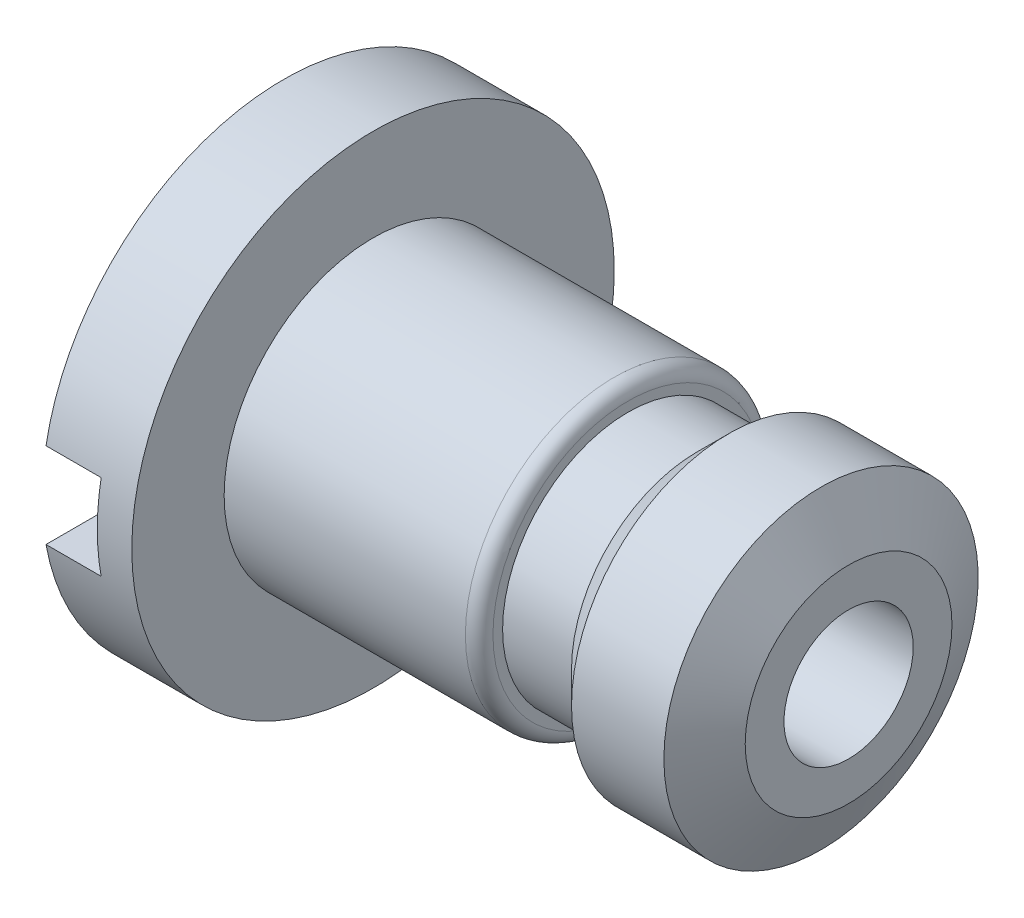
ISO-10303-21;
HEADER;
FILE_DESCRIPTION(('STEP AP214'),'2;1');
FILE_NAME('part.step','',(''),(''),'','','');
FILE_SCHEMA(('AUTOMOTIVE_DESIGN { 1 0 10303 214 1 1 1 1 }'));
ENDSEC;
DATA;
#1=APPLICATION_CONTEXT('core data for automotive mechanical design processes');
#2=APPLICATION_PROTOCOL_DEFINITION('international standard','automotive_design',2000,#1);
#3=PRODUCT_CONTEXT('',#1,'mechanical');
#4=PRODUCT('Part','Part','',(#3));
#5=PRODUCT_RELATED_PRODUCT_CATEGORY('part','',(#4));
#6=PRODUCT_DEFINITION_FORMATION('','',#4);
#7=PRODUCT_DEFINITION_CONTEXT('part definition',#1,'design');
#8=PRODUCT_DEFINITION('design','',#6,#7);
#9=PRODUCT_DEFINITION_SHAPE('','',#8);
#10=(LENGTH_UNIT() NAMED_UNIT(*) SI_UNIT(.MILLI.,.METRE.));
#11=(NAMED_UNIT(*) PLANE_ANGLE_UNIT() SI_UNIT($,.RADIAN.));
#12=(NAMED_UNIT(*) SI_UNIT($,.STERADIAN.) SOLID_ANGLE_UNIT());
#13=UNCERTAINTY_MEASURE_WITH_UNIT(LENGTH_MEASURE(1.E-05),#10,'distance_accuracy_value','');
#14=(GEOMETRIC_REPRESENTATION_CONTEXT(3) GLOBAL_UNCERTAINTY_ASSIGNED_CONTEXT((#13)) GLOBAL_UNIT_ASSIGNED_CONTEXT((#10,
#11,#12)) REPRESENTATION_CONTEXT('',''));
#15=CARTESIAN_POINT('',(0.,0.,0.));
#16=DIRECTION('',(0.,0.,1.));
#17=DIRECTION('',(1.,0.,0.));
#18=AXIS2_PLACEMENT_3D('',#15,#16,#17);
#19=CARTESIAN_POINT('',(1.016,-0.7874,-5.78340477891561));
#20=DIRECTION('',(-1.,0.,0.));
#21=DIRECTION('',(0.,0.,1.));
#22=AXIS2_PLACEMENT_3D('',#19,#20,#21);
#23=PLANE('',#22);
#24=CARTESIAN_POINT('',(1.016,0.,0.));
#25=DIRECTION('',(-1.,0.,0.));
#26=DIRECTION('',(0.,0.,1.));
#27=AXIS2_PLACEMENT_3D('',#24,#25,#26);
#28=CIRCLE('',#27,1.190625);
#29=CARTESIAN_POINT('',(1.016,-0.7874,-0.893078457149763));
#30=VERTEX_POINT('',#29);
#31=CARTESIAN_POINT('',(1.016,0.7874,-0.893078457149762));
#32=VERTEX_POINT('',#31);
#33=EDGE_CURVE('E36',#30,#32,#28,.F.);
#34=ORIENTED_EDGE('',*,*,#33,.T.);
#35=DIRECTION('',(0.,0.,-1.));
#36=VECTOR('',#35,1.);
#37=CARTESIAN_POINT('',(1.016,0.7874,-5.78340477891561));
#38=LINE('',#37,#36);
#39=CARTESIAN_POINT('',(1.016,0.7874,-4.37470298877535));
#40=VERTEX_POINT('',#39);
#41=EDGE_CURVE('E151',#32,#40,#38,.T.);
#42=ORIENTED_EDGE('',*,*,#41,.T.);
#43=CARTESIAN_POINT('',(1.016,0.,0.));
#44=DIRECTION('',(-1.,0.,0.));
#45=DIRECTION('',(0.,0.,1.));
#46=AXIS2_PLACEMENT_3D('',#43,#44,#45);
#47=CIRCLE('',#46,4.445);
#48=CARTESIAN_POINT('',(1.016,-0.7874,-4.37470298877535));
#49=VERTEX_POINT('',#48);
#50=EDGE_CURVE('E158',#40,#49,#47,.T.);
#51=ORIENTED_EDGE('',*,*,#50,.T.);
#52=DIRECTION('',(0.,0.,1.));
#53=VECTOR('',#52,1.);
#54=CARTESIAN_POINT('',(1.016,-0.7874,-5.78340477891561));
#55=LINE('',#54,#53);
#56=EDGE_CURVE('E148',#49,#30,#55,.T.);
#57=ORIENTED_EDGE('',*,*,#56,.T.);
#58=EDGE_LOOP('',(#34,#42,#51,#57));
#59=FACE_BOUND('',#58,.T.);
#60=ADVANCED_FACE('F16',(#59),#23,.T.);
#61=CARTESIAN_POINT('',(0.,0.7874,-5.78340477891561));
#62=DIRECTION('',(0.,-1.,0.));
#63=DIRECTION('',(0.,0.,-1.));
#64=AXIS2_PLACEMENT_3D('',#61,#62,#63);
#65=PLANE('',#64);
#66=DIRECTION('',(1.,0.,0.));
#67=VECTOR('',#66,1.);
#68=CARTESIAN_POINT('',(0.,0.7874,-0.893078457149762));
#69=LINE('',#68,#67);
#70=CARTESIAN_POINT('',(0.,0.7874,-0.893078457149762));
#71=VERTEX_POINT('',#70);
#72=EDGE_CURVE('E142',#32,#71,#69,.F.);
#73=ORIENTED_EDGE('',*,*,#72,.T.);
#74=DIRECTION('',(0.,0.,-1.));
#75=VECTOR('',#74,1.);
#76=CARTESIAN_POINT('',(0.,0.7874,-5.78340477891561));
#77=LINE('',#76,#75);
#78=CARTESIAN_POINT('',(0.,0.7874,-4.37470298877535));
#79=VERTEX_POINT('',#78);
#80=EDGE_CURVE('E48',#71,#79,#77,.T.);
#81=ORIENTED_EDGE('',*,*,#80,.T.);
#82=DIRECTION('',(-1.,0.,0.));
#83=VECTOR('',#82,1.);
#84=CARTESIAN_POINT('',(0.,0.7874,-4.37470298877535));
#85=LINE('',#84,#83);
#86=EDGE_CURVE('E159',#79,#40,#85,.F.);
#87=ORIENTED_EDGE('',*,*,#86,.T.);
#88=ORIENTED_EDGE('',*,*,#41,.F.);
#89=EDGE_LOOP('',(#73,#81,#87,#88));
#90=FACE_BOUND('',#89,.T.);
#91=ADVANCED_FACE('F272',(#90),#65,.T.);
#92=CARTESIAN_POINT('',(0.,-0.7874,-5.78340477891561));
#93=DIRECTION('',(0.,1.,0.));
#94=DIRECTION('',(0.,0.,1.));
#95=AXIS2_PLACEMENT_3D('',#92,#93,#94);
#96=PLANE('',#95);
#97=DIRECTION('',(1.,0.,0.));
#98=VECTOR('',#97,1.);
#99=CARTESIAN_POINT('',(0.,-0.7874,0.893078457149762));
#100=LINE('',#99,#98);
#101=CARTESIAN_POINT('',(1.016,-0.7874,0.893078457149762));
#102=VERTEX_POINT('',#101);
#103=CARTESIAN_POINT('',(0.,-0.7874,0.893078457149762));
#104=VERTEX_POINT('',#103);
#105=EDGE_CURVE('E123',#102,#104,#100,.F.);
#106=ORIENTED_EDGE('',*,*,#105,.T.);
#107=DIRECTION('',(0.,0.,1.));
#108=VECTOR('',#107,1.);
#109=CARTESIAN_POINT('',(0.,-0.7874,-5.78340477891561));
#110=LINE('',#109,#108);
#111=CARTESIAN_POINT('',(0.,-0.7874,4.37470298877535));
#112=VERTEX_POINT('',#111);
#113=EDGE_CURVE('E121',#104,#112,#110,.T.);
#114=ORIENTED_EDGE('',*,*,#113,.T.);
#115=DIRECTION('',(-1.,0.,0.));
#116=VECTOR('',#115,1.);
#117=CARTESIAN_POINT('',(0.,-0.7874,4.37470298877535));
#118=LINE('',#117,#116);
#119=CARTESIAN_POINT('',(1.016,-0.7874,4.37470298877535));
#120=VERTEX_POINT('',#119);
#121=EDGE_CURVE('E166',#112,#120,#118,.F.);
#122=ORIENTED_EDGE('',*,*,#121,.T.);
#123=EDGE_CURVE('E152',#102,#120,#55,.T.);
#124=ORIENTED_EDGE('',*,*,#123,.F.);
#125=EDGE_LOOP('',(#106,#114,#122,#124));
#126=FACE_BOUND('',#125,.T.);
#127=ADVANCED_FACE('F223',(#126),#96,.T.);
#128=CARTESIAN_POINT('',(0.,0.,0.));
#129=DIRECTION('',(1.,0.,0.));
#130=DIRECTION('',(0.,0.,-1.));
#131=AXIS2_PLACEMENT_3D('',#128,#129,#130);
#132=PLANE('',#131);
#133=ORIENTED_EDGE('',*,*,#113,.F.);
#134=CARTESIAN_POINT('',(0.,0.,0.));
#135=DIRECTION('',(1.,0.,0.));
#136=DIRECTION('',(0.,0.,-1.));
#137=AXIS2_PLACEMENT_3D('',#134,#135,#136);
#138=CIRCLE('',#137,1.190625);
#139=CARTESIAN_POINT('',(0.,-0.7874,-0.893078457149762));
#140=VERTEX_POINT('',#139);
#141=EDGE_CURVE('E106',#104,#140,#138,.T.);
#142=ORIENTED_EDGE('',*,*,#141,.T.);
#143=CARTESIAN_POINT('',(0.,-0.7874,-4.37470298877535));
#144=VERTEX_POINT('',#143);
#145=EDGE_CURVE('E119',#144,#140,#110,.T.);
#146=ORIENTED_EDGE('',*,*,#145,.F.);
#147=CARTESIAN_POINT('',(0.,0.,0.));
#148=DIRECTION('',(-1.,0.,0.));
#149=DIRECTION('',(0.,0.,1.));
#150=AXIS2_PLACEMENT_3D('',#147,#148,#149);
#151=CIRCLE('',#150,4.445);
#152=EDGE_CURVE('E25',#144,#112,#151,.T.);
#153=ORIENTED_EDGE('',*,*,#152,.T.);
#154=EDGE_LOOP('',(#133,#142,#146,#153));
#155=FACE_BOUND('',#154,.T.);
#156=ADVANCED_FACE('F18',(#155),#132,.F.);
#157=ORIENTED_EDGE('',*,*,#80,.F.);
#158=CARTESIAN_POINT('',(0.,0.7874,0.893078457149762));
#159=VERTEX_POINT('',#158);
#160=EDGE_CURVE('E125',#71,#159,#138,.T.);
#161=ORIENTED_EDGE('',*,*,#160,.T.);
#162=CARTESIAN_POINT('',(0.,0.7874,4.37470298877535));
#163=VERTEX_POINT('',#162);
#164=EDGE_CURVE('E137',#163,#159,#77,.T.);
#165=ORIENTED_EDGE('',*,*,#164,.F.);
#166=EDGE_CURVE('E10',#163,#79,#151,.T.);
#167=ORIENTED_EDGE('',*,*,#166,.T.);
#168=EDGE_LOOP('',(#157,#161,#165,#167));
#169=FACE_BOUND('',#168,.T.);
#170=ADVANCED_FACE('F262',(#169),#132,.F.);
#171=CARTESIAN_POINT('',(0.,0.,0.));
#172=DIRECTION('',(-1.,0.,0.));
#173=DIRECTION('',(0.,0.,1.));
#174=AXIS2_PLACEMENT_3D('',#171,#172,#173);
#175=CYLINDRICAL_SURFACE('',#174,4.445);
#176=CARTESIAN_POINT('',(1.651,0.,0.));
#177=DIRECTION('',(-1.,0.,0.));
#178=DIRECTION('',(0.,0.,1.));
#179=AXIS2_PLACEMENT_3D('',#176,#177,#178);
#180=CIRCLE('',#179,4.445);
#181=CARTESIAN_POINT('',(1.651,0.,4.445));
#182=VERTEX_POINT('',#181);
#183=EDGE_CURVE('E203',#182,#182,#180,.T.);
#184=ORIENTED_EDGE('',*,*,#183,.T.);
#185=EDGE_LOOP('',(#184));
#186=FACE_BOUND('',#185,.T.);
#187=DIRECTION('',(-1.,0.,0.));
#188=VECTOR('',#187,1.);
#189=CARTESIAN_POINT('',(0.,-0.7874,-4.37470298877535));
#190=LINE('',#189,#188);
#191=EDGE_CURVE('E128',#49,#144,#190,.T.);
#192=ORIENTED_EDGE('',*,*,#191,.F.);
#193=ORIENTED_EDGE('',*,*,#50,.F.);
#194=ORIENTED_EDGE('',*,*,#86,.F.);
#195=ORIENTED_EDGE('',*,*,#166,.F.);
#196=DIRECTION('',(-1.,0.,0.));
#197=VECTOR('',#196,1.);
#198=CARTESIAN_POINT('',(0.,0.7874,4.37470298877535));
#199=LINE('',#198,#197);
#200=CARTESIAN_POINT('',(1.016,0.7874,4.37470298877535));
#201=VERTEX_POINT('',#200);
#202=EDGE_CURVE('E162',#201,#163,#199,.T.);
#203=ORIENTED_EDGE('',*,*,#202,.F.);
#204=EDGE_CURVE('E147',#120,#201,#47,.T.);
#205=ORIENTED_EDGE('',*,*,#204,.F.);
#206=ORIENTED_EDGE('',*,*,#121,.F.);
#207=ORIENTED_EDGE('',*,*,#152,.F.);
#208=EDGE_LOOP('',(#192,#193,#194,#195,#203,#205,#206,#207));
#209=FACE_BOUND('',#208,.T.);
#210=ADVANCED_FACE('F217',(#186,#209),#175,.T.);
#211=CARTESIAN_POINT('',(1.651,4.445,0.));
#212=DIRECTION('',(-1.,0.,0.));
#213=DIRECTION('',(0.,0.,1.));
#214=AXIS2_PLACEMENT_3D('',#211,#212,#213);
#215=PLANE('',#214);
#216=ORIENTED_EDGE('',*,*,#183,.F.);
#217=EDGE_LOOP('',(#216));
#218=FACE_BOUND('',#217,.T.);
#219=CARTESIAN_POINT('',(1.651,0.,0.));
#220=DIRECTION('',(-1.,0.,0.));
#221=DIRECTION('',(0.,0.,1.));
#222=AXIS2_PLACEMENT_3D('',#219,#220,#221);
#223=CIRCLE('',#222,2.7432);
#224=CARTESIAN_POINT('',(1.651,0.,2.7432));
#225=VERTEX_POINT('',#224);
#226=EDGE_CURVE('E200',#225,#225,#223,.T.);
#227=ORIENTED_EDGE('',*,*,#226,.T.);
#228=EDGE_LOOP('',(#227));
#229=FACE_BOUND('',#228,.T.);
#230=ADVANCED_FACE('F270',(#218,#229),#215,.F.);
#231=CARTESIAN_POINT('',(0.,0.,0.));
#232=DIRECTION('',(-1.,0.,0.));
#233=DIRECTION('',(0.,0.,1.));
#234=AXIS2_PLACEMENT_3D('',#231,#232,#233);
#235=CYLINDRICAL_SURFACE('',#234,2.7432);
#236=ORIENTED_EDGE('',*,*,#226,.F.);
#237=EDGE_LOOP('',(#236));
#238=FACE_BOUND('',#237,.T.);
#239=CARTESIAN_POINT('',(6.096,0.,0.));
#240=DIRECTION('',(-1.,0.,0.));
#241=DIRECTION('',(0.,0.,1.));
#242=AXIS2_PLACEMENT_3D('',#239,#240,#241);
#243=CIRCLE('',#242,2.7432);
#244=CARTESIAN_POINT('',(6.096,0.,2.7432));
#245=VERTEX_POINT('',#244);
#246=EDGE_CURVE('E196',#245,#245,#243,.T.);
#247=ORIENTED_EDGE('',*,*,#246,.T.);
#248=EDGE_LOOP('',(#247));
#249=FACE_BOUND('',#248,.T.);
#250=ADVANCED_FACE('F319',(#238,#249),#235,.T.);
#251=CARTESIAN_POINT('',(6.096,0.,0.));
#252=DIRECTION('',(-1.,0.,0.));
#253=DIRECTION('',(0.,0.,1.));
#254=AXIS2_PLACEMENT_3D('',#251,#252,#253);
#255=TOROIDAL_SURFACE('',#254,2.4892,0.254);
#256=ORIENTED_EDGE('',*,*,#246,.F.);
#257=EDGE_LOOP('',(#256));
#258=FACE_BOUND('',#257,.T.);
#259=CARTESIAN_POINT('',(6.35,0.,0.));
#260=DIRECTION('',(-1.,0.,0.));
#261=DIRECTION('',(0.,0.,1.));
#262=AXIS2_PLACEMENT_3D('',#259,#260,#261);
#263=CIRCLE('',#262,2.4892);
#264=CARTESIAN_POINT('',(6.35,0.,2.4892));
#265=VERTEX_POINT('',#264);
#266=EDGE_CURVE('E192',#265,#265,#263,.T.);
#267=ORIENTED_EDGE('',*,*,#266,.T.);
#268=EDGE_LOOP('',(#267));
#269=FACE_BOUND('',#268,.T.);
#270=ADVANCED_FACE('F315',(#258,#269),#255,.T.);
#271=CARTESIAN_POINT('',(6.35,2.4892,0.));
#272=DIRECTION('',(-1.,0.,0.));
#273=DIRECTION('',(0.,0.,1.));
#274=AXIS2_PLACEMENT_3D('',#271,#272,#273);
#275=PLANE('',#274);
#276=ORIENTED_EDGE('',*,*,#266,.F.);
#277=EDGE_LOOP('',(#276));
#278=FACE_BOUND('',#277,.T.);
#279=CARTESIAN_POINT('',(6.34999999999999,0.,0.));
#280=DIRECTION('',(-1.,0.,0.));
#281=DIRECTION('',(0.,0.,1.));
#282=AXIS2_PLACEMENT_3D('',#279,#280,#281);
#283=CIRCLE('',#282,2.3114);
#284=CARTESIAN_POINT('',(6.34999999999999,0.,2.3114));
#285=VERTEX_POINT('',#284);
#286=EDGE_CURVE('E188',#285,#285,#283,.T.);
#287=ORIENTED_EDGE('',*,*,#286,.T.);
#288=EDGE_LOOP('',(#287));
#289=FACE_BOUND('',#288,.T.);
#290=ADVANCED_FACE('F311',(#278,#289),#275,.F.);
#291=CARTESIAN_POINT('',(0.,0.,0.));
#292=DIRECTION('',(-1.,0.,0.));
#293=DIRECTION('',(0.,0.,1.));
#294=AXIS2_PLACEMENT_3D('',#291,#292,#293);
#295=CYLINDRICAL_SURFACE('',#294,2.3114);
#296=ORIENTED_EDGE('',*,*,#286,.F.);
#297=EDGE_LOOP('',(#296));
#298=FACE_BOUND('',#297,.T.);
#299=CARTESIAN_POINT('',(7.62,0.,0.));
#300=DIRECTION('',(-1.,0.,0.));
#301=DIRECTION('',(0.,0.,1.));
#302=AXIS2_PLACEMENT_3D('',#299,#300,#301);
#303=CIRCLE('',#302,2.3114);
#304=CARTESIAN_POINT('',(7.62,0.,2.3114));
#305=VERTEX_POINT('',#304);
#306=EDGE_CURVE('E184',#305,#305,#303,.T.);
#307=ORIENTED_EDGE('',*,*,#306,.T.);
#308=EDGE_LOOP('',(#307));
#309=FACE_BOUND('',#308,.T.);
#310=ADVANCED_FACE('F307',(#298,#309),#295,.T.);
#311=CARTESIAN_POINT('',(8.2042,0.,0.));
#312=DIRECTION('',(1.,0.,0.));
#313=DIRECTION('',(0.,0.,-1.));
#314=AXIS2_PLACEMENT_3D('',#311,#312,#313);
#315=CONICAL_SURFACE('',#314,2.8956,0.78539816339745);
#316=ORIENTED_EDGE('',*,*,#306,.F.);
#317=EDGE_LOOP('',(#316));
#318=FACE_BOUND('',#317,.T.);
#319=CARTESIAN_POINT('',(8.2042,0.,0.));
#320=DIRECTION('',(-1.,0.,0.));
#321=DIRECTION('',(0.,0.,1.));
#322=AXIS2_PLACEMENT_3D('',#319,#320,#321);
#323=CIRCLE('',#322,2.8956);
#324=CARTESIAN_POINT('',(8.2042,0.,2.8956));
#325=VERTEX_POINT('',#324);
#326=EDGE_CURVE('E180',#325,#325,#323,.T.);
#327=ORIENTED_EDGE('',*,*,#326,.T.);
#328=EDGE_LOOP('',(#327));
#329=FACE_BOUND('',#328,.T.);
#330=ADVANCED_FACE('F303',(#318,#329),#315,.T.);
#331=CARTESIAN_POINT('',(0.,0.,0.));
#332=DIRECTION('',(-1.,0.,0.));
#333=DIRECTION('',(0.,0.,1.));
#334=AXIS2_PLACEMENT_3D('',#331,#332,#333);
#335=CYLINDRICAL_SURFACE('',#334,2.8956);
#336=ORIENTED_EDGE('',*,*,#326,.F.);
#337=EDGE_LOOP('',(#336));
#338=FACE_BOUND('',#337,.T.);
#339=CARTESIAN_POINT('',(9.906,0.,0.));
#340=DIRECTION('',(-1.,0.,0.));
#341=DIRECTION('',(0.,0.,1.));
#342=AXIS2_PLACEMENT_3D('',#339,#340,#341);
#343=CIRCLE('',#342,2.8956);
#344=CARTESIAN_POINT('',(9.906,0.,2.8956));
#345=VERTEX_POINT('',#344);
#346=EDGE_CURVE('E176',#345,#345,#343,.T.);
#347=ORIENTED_EDGE('',*,*,#346,.T.);
#348=EDGE_LOOP('',(#347));
#349=FACE_BOUND('',#348,.T.);
#350=ADVANCED_FACE('F294',(#338,#349),#335,.T.);
#351=CARTESIAN_POINT('',(10.414,0.,0.));
#352=DIRECTION('',(-1.,0.,0.));
#353=DIRECTION('',(0.,0.,1.));
#354=AXIS2_PLACEMENT_3D('',#351,#352,#353);
#355=CONICAL_SURFACE('',#354,1.905,1.09694499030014);
#356=ORIENTED_EDGE('',*,*,#346,.F.);
#357=EDGE_LOOP('',(#356));
#358=FACE_BOUND('',#357,.T.);
#359=CARTESIAN_POINT('',(10.414,0.,0.));
#360=DIRECTION('',(-1.,0.,0.));
#361=DIRECTION('',(0.,0.,1.));
#362=AXIS2_PLACEMENT_3D('',#359,#360,#361);
#363=CIRCLE('',#362,1.905);
#364=CARTESIAN_POINT('',(10.414,0.,1.905));
#365=VERTEX_POINT('',#364);
#366=EDGE_CURVE('E172',#365,#365,#363,.T.);
#367=ORIENTED_EDGE('',*,*,#366,.T.);
#368=EDGE_LOOP('',(#367));
#369=FACE_BOUND('',#368,.T.);
#370=ADVANCED_FACE('F287',(#358,#369),#355,.T.);
#371=CARTESIAN_POINT('',(10.414,1.905,0.));
#372=DIRECTION('',(-1.,0.,0.));
#373=DIRECTION('',(0.,0.,1.));
#374=AXIS2_PLACEMENT_3D('',#371,#372,#373);
#375=PLANE('',#374);
#376=CARTESIAN_POINT('',(10.414,0.,0.));
#377=DIRECTION('',(1.,0.,0.));
#378=DIRECTION('',(0.,0.,-1.));
#379=AXIS2_PLACEMENT_3D('',#376,#377,#378);
#380=CIRCLE('',#379,1.190625);
#381=CARTESIAN_POINT('',(10.414,0.,-1.190625));
#382=VERTEX_POINT('',#381);
#383=EDGE_CURVE('E113',#382,#382,#380,.T.);
#384=ORIENTED_EDGE('',*,*,#383,.F.);
#385=EDGE_LOOP('',(#384));
#386=FACE_BOUND('',#385,.T.);
#387=ORIENTED_EDGE('',*,*,#366,.F.);
#388=EDGE_LOOP('',(#387));
#389=FACE_BOUND('',#388,.T.);
#390=ADVANCED_FACE('F281',(#386,#389),#375,.F.);
#391=CARTESIAN_POINT('',(1.016,0.7874,0.893078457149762));
#392=VERTEX_POINT('',#391);
#393=EDGE_CURVE('E225',#392,#102,#28,.F.);
#394=ORIENTED_EDGE('',*,*,#393,.T.);
#395=ORIENTED_EDGE('',*,*,#123,.T.);
#396=ORIENTED_EDGE('',*,*,#204,.T.);
#397=EDGE_CURVE('E140',#201,#392,#38,.T.);
#398=ORIENTED_EDGE('',*,*,#397,.T.);
#399=EDGE_LOOP('',(#394,#395,#396,#398));
#400=FACE_BOUND('',#399,.T.);
#401=ADVANCED_FACE('F259',(#400),#23,.T.);
#402=DIRECTION('',(1.,0.,0.));
#403=VECTOR('',#402,1.);
#404=CARTESIAN_POINT('',(0.,0.7874,0.893078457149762));
#405=LINE('',#404,#403);
#406=EDGE_CURVE('E229',#159,#392,#405,.T.);
#407=ORIENTED_EDGE('',*,*,#406,.T.);
#408=ORIENTED_EDGE('',*,*,#397,.F.);
#409=ORIENTED_EDGE('',*,*,#202,.T.);
#410=ORIENTED_EDGE('',*,*,#164,.T.);
#411=EDGE_LOOP('',(#407,#408,#409,#410));
#412=FACE_BOUND('',#411,.T.);
#413=ADVANCED_FACE('F260',(#412),#65,.T.);
#414=DIRECTION('',(1.,0.,0.));
#415=VECTOR('',#414,1.);
#416=CARTESIAN_POINT('',(0.,-0.7874,-0.893078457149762));
#417=LINE('',#416,#415);
#418=EDGE_CURVE('E103',#140,#30,#417,.T.);
#419=ORIENTED_EDGE('',*,*,#418,.T.);
#420=ORIENTED_EDGE('',*,*,#56,.F.);
#421=ORIENTED_EDGE('',*,*,#191,.T.);
#422=ORIENTED_EDGE('',*,*,#145,.T.);
#423=EDGE_LOOP('',(#419,#420,#421,#422));
#424=FACE_BOUND('',#423,.T.);
#425=ADVANCED_FACE('F126',(#424),#96,.T.);
#426=CARTESIAN_POINT('',(0.,0.,0.));
#427=DIRECTION('',(1.,0.,0.));
#428=DIRECTION('',(0.,0.,-1.));
#429=AXIS2_PLACEMENT_3D('',#426,#427,#428);
#430=CYLINDRICAL_SURFACE('',#429,1.190625);
#431=ORIENTED_EDGE('',*,*,#383,.T.);
#432=EDGE_LOOP('',(#431));
#433=FACE_BOUND('',#432,.T.);
#434=ORIENTED_EDGE('',*,*,#418,.F.);
#435=ORIENTED_EDGE('',*,*,#141,.F.);
#436=ORIENTED_EDGE('',*,*,#105,.F.);
#437=ORIENTED_EDGE('',*,*,#393,.F.);
#438=ORIENTED_EDGE('',*,*,#406,.F.);
#439=ORIENTED_EDGE('',*,*,#160,.F.);
#440=ORIENTED_EDGE('',*,*,#72,.F.);
#441=ORIENTED_EDGE('',*,*,#33,.F.);
#442=EDGE_LOOP('',(#434,#435,#436,#437,#438,#439,#440,#441));
#443=FACE_BOUND('',#442,.T.);
#444=ADVANCED_FACE('F105',(#433,#443),#430,.F.);
#445=CLOSED_SHELL('',(#60,#91,#127,#156,#170,#210,#230,#250,#270,#290,#310,#330,#350,#370,#390,
#401,#413,#425,#444));
#446=MANIFOLD_SOLID_BREP('B1',#445);
#447=ADVANCED_BREP_SHAPE_REPRESENTATION('',(#18,#446),#14);
#448=SHAPE_DEFINITION_REPRESENTATION(#9,#447);
ENDSEC;
END-ISO-10303-21;
